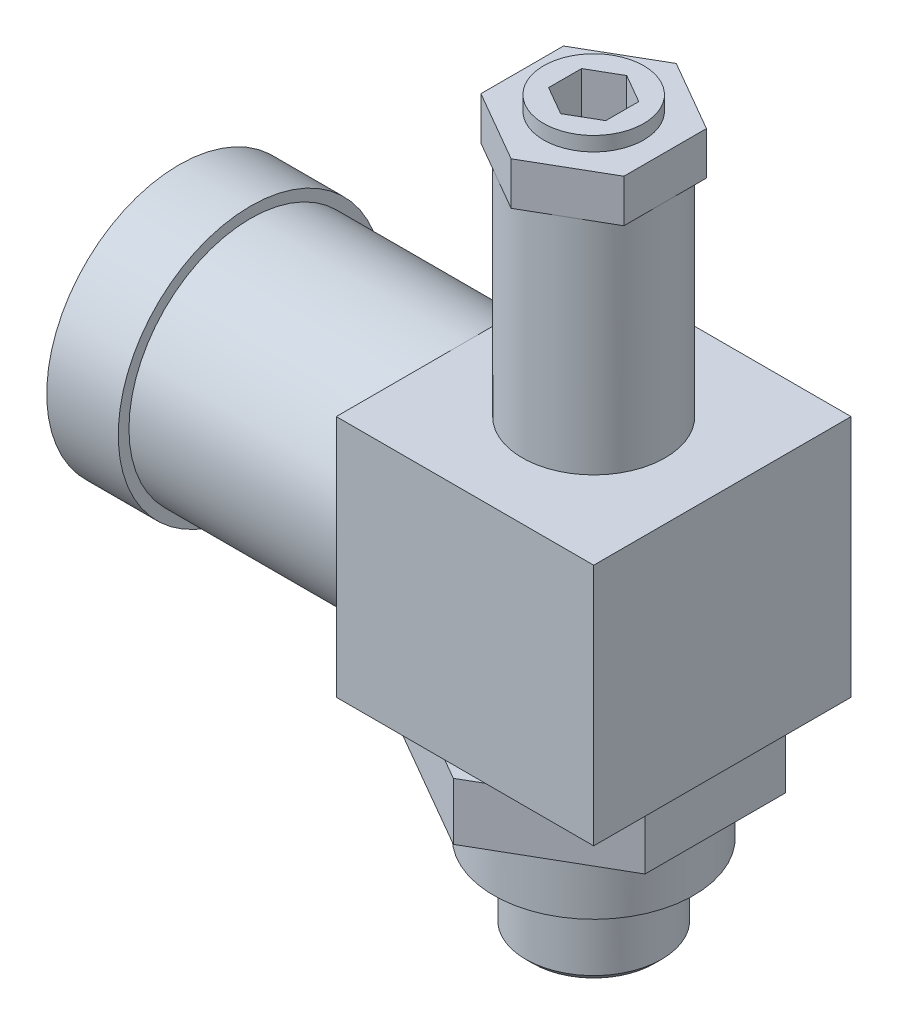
ISO-10303-21;
HEADER;
FILE_DESCRIPTION(('STEP AP214'),'2;1');
FILE_NAME('part.step','',(''),(''),'','','');
FILE_SCHEMA(('AUTOMOTIVE_DESIGN { 1 0 10303 214 1 1 1 1 }'));
ENDSEC;
DATA;
#1=APPLICATION_CONTEXT('core data for automotive mechanical design processes');
#2=APPLICATION_PROTOCOL_DEFINITION('international standard','automotive_design',2000,#1);
#3=PRODUCT_CONTEXT('',#1,'mechanical');
#4=PRODUCT('Part','Part','',(#3));
#5=PRODUCT_RELATED_PRODUCT_CATEGORY('part','',(#4));
#6=PRODUCT_DEFINITION_FORMATION('','',#4);
#7=PRODUCT_DEFINITION_CONTEXT('part definition',#1,'design');
#8=PRODUCT_DEFINITION('design','',#6,#7);
#9=PRODUCT_DEFINITION_SHAPE('','',#8);
#10=(LENGTH_UNIT() NAMED_UNIT(*) SI_UNIT(.MILLI.,.METRE.));
#11=(NAMED_UNIT(*) PLANE_ANGLE_UNIT() SI_UNIT($,.RADIAN.));
#12=(NAMED_UNIT(*) SI_UNIT($,.STERADIAN.) SOLID_ANGLE_UNIT());
#13=UNCERTAINTY_MEASURE_WITH_UNIT(LENGTH_MEASURE(1.E-05),#10,'distance_accuracy_value','');
#14=(GEOMETRIC_REPRESENTATION_CONTEXT(3) GLOBAL_UNCERTAINTY_ASSIGNED_CONTEXT((#13)) GLOBAL_UNIT_ASSIGNED_CONTEXT((#10,
#11,#12)) REPRESENTATION_CONTEXT('',''));
#15=CARTESIAN_POINT('',(0.,0.,0.));
#16=DIRECTION('',(0.,0.,1.));
#17=DIRECTION('',(1.,0.,0.));
#18=AXIS2_PLACEMENT_3D('',#15,#16,#17);
#19=CARTESIAN_POINT('',(-9.,-8.5,9.));
#20=DIRECTION('',(0.,1.,0.));
#21=DIRECTION('',(0.,0.,1.));
#22=AXIS2_PLACEMENT_3D('',#19,#20,#21);
#23=PLANE('',#22);
#24=DIRECTION('',(-0.866025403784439,0.,-0.5));
#25=VECTOR('',#24,1.);
#26=CARTESIAN_POINT('',(0.,-8.5,9.81495457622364));
#27=LINE('',#26,#25);
#28=CARTESIAN_POINT('',(-1.41154273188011,-8.5,9.));
#29=VERTEX_POINT('',#28);
#30=CARTESIAN_POINT('',(-8.5,-8.5,4.90747728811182));
#31=VERTEX_POINT('',#30);
#32=EDGE_CURVE('E235',#29,#31,#27,.T.);
#33=ORIENTED_EDGE('',*,*,#32,.F.);
#34=DIRECTION('',(1.,0.,0.));
#35=VECTOR('',#34,1.);
#36=CARTESIAN_POINT('',(-9.,-8.5,9.));
#37=LINE('',#36,#35);
#38=CARTESIAN_POINT('',(-9.,-8.5,9.));
#39=VERTEX_POINT('',#38);
#40=EDGE_CURVE('E383',#39,#29,#37,.T.);
#41=ORIENTED_EDGE('',*,*,#40,.F.);
#42=DIRECTION('',(0.,0.,-1.));
#43=VECTOR('',#42,1.);
#44=CARTESIAN_POINT('',(-9.,-8.5,9.));
#45=LINE('',#44,#43);
#46=CARTESIAN_POINT('',(-9.,-8.5,0.));
#47=VERTEX_POINT('',#46);
#48=EDGE_CURVE('E401',#39,#47,#45,.T.);
#49=ORIENTED_EDGE('',*,*,#48,.T.);
#50=CARTESIAN_POINT('',(-9.,-8.5,-9.));
#51=VERTEX_POINT('',#50);
#52=EDGE_CURVE('E400',#47,#51,#45,.T.);
#53=ORIENTED_EDGE('',*,*,#52,.T.);
#54=DIRECTION('',(1.,0.,0.));
#55=VECTOR('',#54,1.);
#56=CARTESIAN_POINT('',(-9.,-8.5,-9.));
#57=LINE('',#56,#55);
#58=CARTESIAN_POINT('',(-1.41154273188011,-8.5,-9.));
#59=VERTEX_POINT('',#58);
#60=EDGE_CURVE('E372',#51,#59,#57,.T.);
#61=ORIENTED_EDGE('',*,*,#60,.T.);
#62=DIRECTION('',(0.866025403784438,0.,-0.5));
#63=VECTOR('',#62,1.);
#64=CARTESIAN_POINT('',(-8.5,-8.5,-4.90747728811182));
#65=LINE('',#64,#63);
#66=CARTESIAN_POINT('',(-8.5,-8.5,-4.90747728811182));
#67=VERTEX_POINT('',#66);
#68=EDGE_CURVE('E53',#67,#59,#65,.T.);
#69=ORIENTED_EDGE('',*,*,#68,.F.);
#70=DIRECTION('',(0.,0.,-1.));
#71=VECTOR('',#70,1.);
#72=CARTESIAN_POINT('',(-8.5,-8.5,4.90747728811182));
#73=LINE('',#72,#71);
#74=EDGE_CURVE('E48',#31,#67,#73,.T.);
#75=ORIENTED_EDGE('',*,*,#74,.F.);
#76=EDGE_LOOP('',(#33,#41,#49,#53,#61,#69,#75));
#77=FACE_BOUND('',#76,.T.);
#78=ADVANCED_FACE('F33',(#77),#23,.F.);
#79=DIRECTION('',(-0.866025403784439,0.,0.5));
#80=VECTOR('',#79,1.);
#81=CARTESIAN_POINT('',(8.5,-8.5,4.90747728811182));
#82=LINE('',#81,#80);
#83=CARTESIAN_POINT('',(8.49999999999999,-8.5,4.90747728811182));
#84=VERTEX_POINT('',#83);
#85=CARTESIAN_POINT('',(1.4115427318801,-8.5,9.));
#86=VERTEX_POINT('',#85);
#87=EDGE_CURVE('E225',#84,#86,#82,.T.);
#88=ORIENTED_EDGE('',*,*,#87,.F.);
#89=DIRECTION('',(0.,0.,1.));
#90=VECTOR('',#89,1.);
#91=CARTESIAN_POINT('',(8.5,-8.5,-4.90747728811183));
#92=LINE('',#91,#90);
#93=CARTESIAN_POINT('',(8.49999999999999,-8.5,-4.90747728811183));
#94=VERTEX_POINT('',#93);
#95=EDGE_CURVE('E568',#94,#84,#92,.T.);
#96=ORIENTED_EDGE('',*,*,#95,.F.);
#97=DIRECTION('',(0.866025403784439,0.,0.5));
#98=VECTOR('',#97,1.);
#99=CARTESIAN_POINT('',(0.,-8.5,-9.81495457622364));
#100=LINE('',#99,#98);
#101=CARTESIAN_POINT('',(1.41154273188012,-8.5,-9.));
#102=VERTEX_POINT('',#101);
#103=EDGE_CURVE('E563',#102,#94,#100,.T.);
#104=ORIENTED_EDGE('',*,*,#103,.F.);
#105=CARTESIAN_POINT('',(9.,-8.5,-9.));
#106=VERTEX_POINT('',#105);
#107=EDGE_CURVE('E371',#102,#106,#57,.T.);
#108=ORIENTED_EDGE('',*,*,#107,.T.);
#109=DIRECTION('',(0.,0.,-1.));
#110=VECTOR('',#109,1.);
#111=CARTESIAN_POINT('',(9.,-8.5,9.));
#112=LINE('',#111,#110);
#113=CARTESIAN_POINT('',(9.,-8.5,9.));
#114=VERTEX_POINT('',#113);
#115=EDGE_CURVE('E397',#114,#106,#112,.T.);
#116=ORIENTED_EDGE('',*,*,#115,.F.);
#117=EDGE_CURVE('E382',#86,#114,#37,.T.);
#118=ORIENTED_EDGE('',*,*,#117,.F.);
#119=EDGE_LOOP('',(#88,#96,#104,#108,#116,#118));
#120=FACE_BOUND('',#119,.T.);
#121=ADVANCED_FACE('F460',(#120),#23,.F.);
#122=CARTESIAN_POINT('',(-9.,8.5,9.));
#123=DIRECTION('',(0.,-1.,0.));
#124=DIRECTION('',(0.,0.,-1.));
#125=AXIS2_PLACEMENT_3D('',#122,#123,#124);
#126=PLANE('',#125);
#127=DIRECTION('',(-1.,0.,0.));
#128=VECTOR('',#127,1.);
#129=CARTESIAN_POINT('',(-9.,8.5,-9.));
#130=LINE('',#129,#128);
#131=CARTESIAN_POINT('',(9.,8.5,-9.));
#132=VERTEX_POINT('',#131);
#133=CARTESIAN_POINT('',(-9.,8.5,-9.));
#134=VERTEX_POINT('',#133);
#135=EDGE_CURVE('E376',#132,#134,#130,.T.);
#136=ORIENTED_EDGE('',*,*,#135,.T.);
#137=DIRECTION('',(0.,0.,-1.));
#138=VECTOR('',#137,1.);
#139=CARTESIAN_POINT('',(-9.,8.5,9.));
#140=LINE('',#139,#138);
#141=CARTESIAN_POINT('',(-9.,8.5,0.));
#142=VERTEX_POINT('',#141);
#143=EDGE_CURVE('E390',#142,#134,#140,.T.);
#144=ORIENTED_EDGE('',*,*,#143,.F.);
#145=CARTESIAN_POINT('',(-9.,8.5,9.));
#146=VERTEX_POINT('',#145);
#147=EDGE_CURVE('E391',#146,#142,#140,.T.);
#148=ORIENTED_EDGE('',*,*,#147,.F.);
#149=DIRECTION('',(-1.,0.,0.));
#150=VECTOR('',#149,1.);
#151=CARTESIAN_POINT('',(-9.,8.5,9.));
#152=LINE('',#151,#150);
#153=CARTESIAN_POINT('',(9.,8.5,9.));
#154=VERTEX_POINT('',#153);
#155=EDGE_CURVE('E388',#154,#146,#152,.T.);
#156=ORIENTED_EDGE('',*,*,#155,.F.);
#157=DIRECTION('',(0.,0.,-1.));
#158=VECTOR('',#157,1.);
#159=CARTESIAN_POINT('',(9.,8.5,9.));
#160=LINE('',#159,#158);
#161=EDGE_CURVE('E394',#154,#132,#160,.T.);
#162=ORIENTED_EDGE('',*,*,#161,.T.);
#163=EDGE_LOOP('',(#136,#144,#148,#156,#162));
#164=FACE_BOUND('',#163,.T.);
#165=CARTESIAN_POINT('',(0.,8.5,0.));
#166=DIRECTION('',(0.,-1.,0.));
#167=DIRECTION('',(0.,0.,-1.));
#168=AXIS2_PLACEMENT_3D('',#165,#166,#167);
#169=CIRCLE('',#168,5.);
#170=CARTESIAN_POINT('',(0.,8.5,-5.));
#171=VERTEX_POINT('',#170);
#172=EDGE_CURVE('E434',#171,#171,#169,.F.);
#173=ORIENTED_EDGE('',*,*,#172,.F.);
#174=EDGE_LOOP('',(#173));
#175=FACE_BOUND('',#174,.T.);
#176=ADVANCED_FACE('F465',(#164,#175),#126,.F.);
#177=CARTESIAN_POINT('',(-24.,0.,0.));
#178=DIRECTION('',(1.,0.,0.));
#179=DIRECTION('',(0.,1.,0.));
#180=AXIS2_PLACEMENT_3D('',#177,#178,#179);
#181=PLANE('',#180);
#182=CARTESIAN_POINT('',(-24.,0.,0.));
#183=DIRECTION('',(-1.,0.,0.));
#184=DIRECTION('',(0.,-1.,0.));
#185=AXIS2_PLACEMENT_3D('',#182,#183,#184);
#186=CIRCLE('',#185,2.);
#187=CARTESIAN_POINT('',(-24.,-2.,0.));
#188=VERTEX_POINT('',#187);
#189=EDGE_CURVE('E431',#188,#188,#186,.T.);
#190=ORIENTED_EDGE('',*,*,#189,.T.);
#191=EDGE_LOOP('',(#190));
#192=FACE_BOUND('',#191,.T.);
#193=ADVANCED_FACE('F35',(#192),#181,.F.);
#194=CARTESIAN_POINT('',(-9.,0.,0.));
#195=DIRECTION('',(-1.,0.,0.));
#196=DIRECTION('',(0.,-1.,0.));
#197=AXIS2_PLACEMENT_3D('',#194,#195,#196);
#198=CYLINDRICAL_SURFACE('',#197,2.);
#199=ORIENTED_EDGE('',*,*,#189,.F.);
#200=EDGE_LOOP('',(#199));
#201=FACE_BOUND('',#200,.T.);
#202=CARTESIAN_POINT('',(-32.,0.,0.));
#203=DIRECTION('',(-1.,0.,0.));
#204=DIRECTION('',(0.,-1.,0.));
#205=AXIS2_PLACEMENT_3D('',#202,#203,#204);
#206=CIRCLE('',#205,2.);
#207=CARTESIAN_POINT('',(-32.,-2.,0.));
#208=VERTEX_POINT('',#207);
#209=EDGE_CURVE('E428',#208,#208,#206,.T.);
#210=ORIENTED_EDGE('',*,*,#209,.T.);
#211=EDGE_LOOP('',(#210));
#212=FACE_BOUND('',#211,.T.);
#213=ADVANCED_FACE('F506',(#201,#212),#198,.F.);
#214=CARTESIAN_POINT('',(-32.,2.,0.));
#215=DIRECTION('',(1.,0.,0.));
#216=DIRECTION('',(0.,1.,0.));
#217=AXIS2_PLACEMENT_3D('',#214,#215,#216);
#218=PLANE('',#217);
#219=ORIENTED_EDGE('',*,*,#209,.F.);
#220=EDGE_LOOP('',(#219));
#221=FACE_BOUND('',#220,.T.);
#222=CARTESIAN_POINT('',(-32.,0.,0.));
#223=DIRECTION('',(-1.,0.,0.));
#224=DIRECTION('',(0.,-1.,0.));
#225=AXIS2_PLACEMENT_3D('',#222,#223,#224);
#226=CIRCLE('',#225,4.25);
#227=CARTESIAN_POINT('',(-32.,-4.25,0.));
#228=VERTEX_POINT('',#227);
#229=EDGE_CURVE('E425',#228,#228,#226,.T.);
#230=ORIENTED_EDGE('',*,*,#229,.T.);
#231=EDGE_LOOP('',(#230));
#232=FACE_BOUND('',#231,.T.);
#233=ADVANCED_FACE('F503',(#221,#232),#218,.F.);
#234=CARTESIAN_POINT('',(-9.,0.,0.));
#235=DIRECTION('',(-1.,0.,0.));
#236=DIRECTION('',(0.,-1.,0.));
#237=AXIS2_PLACEMENT_3D('',#234,#235,#236);
#238=CYLINDRICAL_SURFACE('',#237,4.25);
#239=ORIENTED_EDGE('',*,*,#229,.F.);
#240=EDGE_LOOP('',(#239));
#241=FACE_BOUND('',#240,.T.);
#242=CARTESIAN_POINT('',(-30.,0.,0.));
#243=DIRECTION('',(-1.,0.,0.));
#244=DIRECTION('',(0.,-1.,0.));
#245=AXIS2_PLACEMENT_3D('',#242,#243,#244);
#246=CIRCLE('',#245,4.25);
#247=CARTESIAN_POINT('',(-30.,-4.25,0.));
#248=VERTEX_POINT('',#247);
#249=EDGE_CURVE('E422',#248,#248,#246,.T.);
#250=ORIENTED_EDGE('',*,*,#249,.T.);
#251=EDGE_LOOP('',(#250));
#252=FACE_BOUND('',#251,.T.);
#253=ADVANCED_FACE('F499',(#241,#252),#238,.T.);
#254=CARTESIAN_POINT('',(-30.,4.25,0.));
#255=DIRECTION('',(-1.,0.,0.));
#256=DIRECTION('',(0.,-1.,0.));
#257=AXIS2_PLACEMENT_3D('',#254,#255,#256);
#258=PLANE('',#257);
#259=ORIENTED_EDGE('',*,*,#249,.F.);
#260=EDGE_LOOP('',(#259));
#261=FACE_BOUND('',#260,.T.);
#262=CARTESIAN_POINT('',(-30.,0.,0.));
#263=DIRECTION('',(-1.,0.,0.));
#264=DIRECTION('',(0.,-1.,0.));
#265=AXIS2_PLACEMENT_3D('',#262,#263,#264);
#266=CIRCLE('',#265,3.5);
#267=CARTESIAN_POINT('',(-30.,-3.5,0.));
#268=VERTEX_POINT('',#267);
#269=EDGE_CURVE('E419',#268,#268,#266,.T.);
#270=ORIENTED_EDGE('',*,*,#269,.T.);
#271=EDGE_LOOP('',(#270));
#272=FACE_BOUND('',#271,.T.);
#273=ADVANCED_FACE('F495',(#261,#272),#258,.F.);
#274=CARTESIAN_POINT('',(-9.,0.,0.));
#275=DIRECTION('',(-1.,0.,0.));
#276=DIRECTION('',(0.,-1.,0.));
#277=AXIS2_PLACEMENT_3D('',#274,#275,#276);
#278=CYLINDRICAL_SURFACE('',#277,3.5);
#279=ORIENTED_EDGE('',*,*,#269,.F.);
#280=EDGE_LOOP('',(#279));
#281=FACE_BOUND('',#280,.T.);
#282=CARTESIAN_POINT('',(-29.,0.,0.));
#283=DIRECTION('',(-1.,0.,0.));
#284=DIRECTION('',(0.,-1.,0.));
#285=AXIS2_PLACEMENT_3D('',#282,#283,#284);
#286=CIRCLE('',#285,3.5);
#287=CARTESIAN_POINT('',(-29.,-3.5,0.));
#288=VERTEX_POINT('',#287);
#289=EDGE_CURVE('E416',#288,#288,#286,.T.);
#290=ORIENTED_EDGE('',*,*,#289,.T.);
#291=EDGE_LOOP('',(#290));
#292=FACE_BOUND('',#291,.T.);
#293=ADVANCED_FACE('F491',(#281,#292),#278,.T.);
#294=CARTESIAN_POINT('',(-29.,3.5,0.));
#295=DIRECTION('',(1.,0.,0.));
#296=DIRECTION('',(0.,1.,0.));
#297=AXIS2_PLACEMENT_3D('',#294,#295,#296);
#298=PLANE('',#297);
#299=ORIENTED_EDGE('',*,*,#289,.F.);
#300=EDGE_LOOP('',(#299));
#301=FACE_BOUND('',#300,.T.);
#302=CARTESIAN_POINT('',(-29.,0.,0.));
#303=DIRECTION('',(-1.,0.,0.));
#304=DIRECTION('',(0.,-1.,0.));
#305=AXIS2_PLACEMENT_3D('',#302,#303,#304);
#306=CIRCLE('',#305,9.25);
#307=CARTESIAN_POINT('',(-29.,-9.25,0.));
#308=VERTEX_POINT('',#307);
#309=EDGE_CURVE('E413',#308,#308,#306,.T.);
#310=ORIENTED_EDGE('',*,*,#309,.T.);
#311=EDGE_LOOP('',(#310));
#312=FACE_BOUND('',#311,.T.);
#313=ADVANCED_FACE('F487',(#301,#312),#298,.F.);
#314=CARTESIAN_POINT('',(-9.,0.,0.));
#315=DIRECTION('',(-1.,0.,0.));
#316=DIRECTION('',(0.,-1.,0.));
#317=AXIS2_PLACEMENT_3D('',#314,#315,#316);
#318=CYLINDRICAL_SURFACE('',#317,9.25);
#319=ORIENTED_EDGE('',*,*,#309,.F.);
#320=EDGE_LOOP('',(#319));
#321=FACE_BOUND('',#320,.T.);
#322=CARTESIAN_POINT('',(-24.,0.,0.));
#323=DIRECTION('',(-1.,0.,0.));
#324=DIRECTION('',(0.,-1.,0.));
#325=AXIS2_PLACEMENT_3D('',#322,#323,#324);
#326=CIRCLE('',#325,9.25);
#327=CARTESIAN_POINT('',(-24.,-9.25,0.));
#328=VERTEX_POINT('',#327);
#329=EDGE_CURVE('E410',#328,#328,#326,.T.);
#330=ORIENTED_EDGE('',*,*,#329,.T.);
#331=EDGE_LOOP('',(#330));
#332=FACE_BOUND('',#331,.T.);
#333=ADVANCED_FACE('F483',(#321,#332),#318,.T.);
#334=CARTESIAN_POINT('',(-24.,9.25,0.));
#335=DIRECTION('',(-1.,0.,0.));
#336=DIRECTION('',(0.,-1.,0.));
#337=AXIS2_PLACEMENT_3D('',#334,#335,#336);
#338=PLANE('',#337);
#339=ORIENTED_EDGE('',*,*,#329,.F.);
#340=EDGE_LOOP('',(#339));
#341=FACE_BOUND('',#340,.T.);
#342=CARTESIAN_POINT('',(-24.,0.,0.));
#343=DIRECTION('',(-1.,0.,0.));
#344=DIRECTION('',(0.,-1.,0.));
#345=AXIS2_PLACEMENT_3D('',#342,#343,#344);
#346=CIRCLE('',#345,8.5);
#347=CARTESIAN_POINT('',(-24.,-8.5,0.));
#348=VERTEX_POINT('',#347);
#349=EDGE_CURVE('E407',#348,#348,#346,.T.);
#350=ORIENTED_EDGE('',*,*,#349,.T.);
#351=EDGE_LOOP('',(#350));
#352=FACE_BOUND('',#351,.T.);
#353=ADVANCED_FACE('F479',(#341,#352),#338,.F.);
#354=CARTESIAN_POINT('',(-9.,0.,0.));
#355=DIRECTION('',(-1.,0.,0.));
#356=DIRECTION('',(0.,-1.,0.));
#357=AXIS2_PLACEMENT_3D('',#354,#355,#356);
#358=CYLINDRICAL_SURFACE('',#357,8.5);
#359=ORIENTED_EDGE('',*,*,#349,.F.);
#360=EDGE_LOOP('',(#359));
#361=FACE_BOUND('',#360,.T.);
#362=CARTESIAN_POINT('',(-9.,0.,0.));
#363=DIRECTION('',(-1.,0.,0.));
#364=DIRECTION('',(0.,-1.,0.));
#365=AXIS2_PLACEMENT_3D('',#362,#363,#364);
#366=CIRCLE('',#365,8.5);
#367=EDGE_CURVE('E404',#47,#142,#366,.T.);
#368=ORIENTED_EDGE('',*,*,#367,.T.);
#369=EDGE_CURVE('E403',#142,#47,#366,.T.);
#370=ORIENTED_EDGE('',*,*,#369,.T.);
#371=EDGE_LOOP('',(#368,#370));
#372=FACE_BOUND('',#371,.T.);
#373=ADVANCED_FACE('F476',(#361,#372),#358,.T.);
#374=CARTESIAN_POINT('',(-9.,8.5,9.));
#375=DIRECTION('',(1.,0.,0.));
#376=DIRECTION('',(0.,0.,-1.));
#377=AXIS2_PLACEMENT_3D('',#374,#375,#376);
#378=PLANE('',#377);
#379=ORIENTED_EDGE('',*,*,#367,.F.);
#380=ORIENTED_EDGE('',*,*,#48,.F.);
#381=DIRECTION('',(0.,-1.,0.));
#382=VECTOR('',#381,1.);
#383=CARTESIAN_POINT('',(-9.,8.5,9.));
#384=LINE('',#383,#382);
#385=EDGE_CURVE('E379',#146,#39,#384,.T.);
#386=ORIENTED_EDGE('',*,*,#385,.F.);
#387=ORIENTED_EDGE('',*,*,#147,.T.);
#388=EDGE_LOOP('',(#379,#380,#386,#387));
#389=FACE_BOUND('',#388,.T.);
#390=ADVANCED_FACE('F474',(#389),#378,.F.);
#391=ORIENTED_EDGE('',*,*,#369,.F.);
#392=ORIENTED_EDGE('',*,*,#143,.T.);
#393=DIRECTION('',(0.,-1.,0.));
#394=VECTOR('',#393,1.);
#395=CARTESIAN_POINT('',(-9.,8.5,-9.));
#396=LINE('',#395,#394);
#397=EDGE_CURVE('E367',#134,#51,#396,.T.);
#398=ORIENTED_EDGE('',*,*,#397,.T.);
#399=ORIENTED_EDGE('',*,*,#52,.F.);
#400=EDGE_LOOP('',(#391,#392,#398,#399));
#401=FACE_BOUND('',#400,.T.);
#402=ADVANCED_FACE('F471',(#401),#378,.F.);
#403=CARTESIAN_POINT('',(9.,8.5,9.));
#404=DIRECTION('',(-1.,0.,0.));
#405=DIRECTION('',(0.,0.,1.));
#406=AXIS2_PLACEMENT_3D('',#403,#404,#405);
#407=PLANE('',#406);
#408=DIRECTION('',(0.,1.,0.));
#409=VECTOR('',#408,1.);
#410=CARTESIAN_POINT('',(9.,8.5,-9.));
#411=LINE('',#410,#409);
#412=EDGE_CURVE('E374',#106,#132,#411,.T.);
#413=ORIENTED_EDGE('',*,*,#412,.T.);
#414=ORIENTED_EDGE('',*,*,#161,.F.);
#415=DIRECTION('',(0.,1.,0.));
#416=VECTOR('',#415,1.);
#417=CARTESIAN_POINT('',(9.,8.5,9.));
#418=LINE('',#417,#416);
#419=EDGE_CURVE('E386',#114,#154,#418,.T.);
#420=ORIENTED_EDGE('',*,*,#419,.F.);
#421=ORIENTED_EDGE('',*,*,#115,.T.);
#422=EDGE_LOOP('',(#413,#414,#420,#421));
#423=FACE_BOUND('',#422,.T.);
#424=ADVANCED_FACE('F469',(#423),#407,.F.);
#425=CARTESIAN_POINT('',(-9.,-8.5,9.));
#426=DIRECTION('',(0.,0.,1.));
#427=DIRECTION('',(1.,0.,0.));
#428=AXIS2_PLACEMENT_3D('',#425,#426,#427);
#429=PLANE('',#428);
#430=ORIENTED_EDGE('',*,*,#385,.T.);
#431=ORIENTED_EDGE('',*,*,#40,.T.);
#432=DIRECTION('',(-1.,0.,0.));
#433=VECTOR('',#432,1.);
#434=CARTESIAN_POINT('',(-9.,-8.5,9.));
#435=LINE('',#434,#433);
#436=EDGE_CURVE('E233',#86,#29,#435,.T.);
#437=ORIENTED_EDGE('',*,*,#436,.F.);
#438=ORIENTED_EDGE('',*,*,#117,.T.);
#439=ORIENTED_EDGE('',*,*,#419,.T.);
#440=ORIENTED_EDGE('',*,*,#155,.T.);
#441=EDGE_LOOP('',(#430,#431,#437,#438,#439,#440));
#442=FACE_BOUND('',#441,.T.);
#443=ADVANCED_FACE('F599',(#442),#429,.T.);
#444=CARTESIAN_POINT('',(-9.,-8.5,-9.));
#445=DIRECTION('',(0.,0.,1.));
#446=DIRECTION('',(1.,0.,0.));
#447=AXIS2_PLACEMENT_3D('',#444,#445,#446);
#448=PLANE('',#447);
#449=ORIENTED_EDGE('',*,*,#397,.F.);
#450=ORIENTED_EDGE('',*,*,#135,.F.);
#451=ORIENTED_EDGE('',*,*,#412,.F.);
#452=ORIENTED_EDGE('',*,*,#107,.F.);
#453=DIRECTION('',(-1.,0.,0.));
#454=VECTOR('',#453,1.);
#455=CARTESIAN_POINT('',(-9.,-8.5,-9.));
#456=LINE('',#455,#454);
#457=EDGE_CURVE('E241',#102,#59,#456,.T.);
#458=ORIENTED_EDGE('',*,*,#457,.T.);
#459=ORIENTED_EDGE('',*,*,#60,.F.);
#460=EDGE_LOOP('',(#449,#450,#451,#452,#458,#459));
#461=FACE_BOUND('',#460,.T.);
#462=ADVANCED_FACE('F548',(#461),#448,.F.);
#463=CARTESIAN_POINT('',(0.,0.,0.));
#464=DIRECTION('',(0.,-1.,0.));
#465=DIRECTION('',(0.,0.,-1.));
#466=AXIS2_PLACEMENT_3D('',#463,#464,#465);
#467=CYLINDRICAL_SURFACE('',#466,5.);
#468=CARTESIAN_POINT('',(0.,24.,0.));
#469=DIRECTION('',(0.,-1.,0.));
#470=DIRECTION('',(0.,0.,-1.));
#471=AXIS2_PLACEMENT_3D('',#468,#469,#470);
#472=CIRCLE('',#471,5.);
#473=CARTESIAN_POINT('',(2.5,24.,-4.33012701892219));
#474=VERTEX_POINT('',#473);
#475=CARTESIAN_POINT('',(5.,24.,0.));
#476=VERTEX_POINT('',#475);
#477=EDGE_CURVE('E364',#474,#476,#472,.T.);
#478=ORIENTED_EDGE('',*,*,#477,.T.);
#479=CARTESIAN_POINT('',(2.5,24.,4.3301270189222));
#480=VERTEX_POINT('',#479);
#481=EDGE_CURVE('E368',#476,#480,#472,.T.);
#482=ORIENTED_EDGE('',*,*,#481,.T.);
#483=CARTESIAN_POINT('',(-2.5,24.,4.33012701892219));
#484=VERTEX_POINT('',#483);
#485=EDGE_CURVE('E1060',#480,#484,#472,.T.);
#486=ORIENTED_EDGE('',*,*,#485,.T.);
#487=CARTESIAN_POINT('',(-5.,24.,0.));
#488=VERTEX_POINT('',#487);
#489=EDGE_CURVE('E1066',#484,#488,#472,.T.);
#490=ORIENTED_EDGE('',*,*,#489,.T.);
#491=CARTESIAN_POINT('',(-2.5,24.,-4.3301270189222));
#492=VERTEX_POINT('',#491);
#493=EDGE_CURVE('E1068',#488,#492,#472,.T.);
#494=ORIENTED_EDGE('',*,*,#493,.T.);
#495=EDGE_CURVE('E363',#492,#474,#472,.T.);
#496=ORIENTED_EDGE('',*,*,#495,.T.);
#497=EDGE_LOOP('',(#478,#482,#486,#490,#494,#496));
#498=FACE_BOUND('',#497,.T.);
#499=ORIENTED_EDGE('',*,*,#172,.T.);
#500=EDGE_LOOP('',(#499));
#501=FACE_BOUND('',#500,.T.);
#502=ADVANCED_FACE('F669',(#498,#501),#467,.T.);
#503=CARTESIAN_POINT('',(-5.,27.,-2.88675134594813));
#504=DIRECTION('',(0.,1.,0.));
#505=DIRECTION('',(0.,0.,1.));
#506=AXIS2_PLACEMENT_3D('',#503,#504,#505);
#507=PLANE('',#506);
#508=DIRECTION('',(-0.866025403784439,0.,0.5));
#509=VECTOR('',#508,1.);
#510=CARTESIAN_POINT('',(0.,27.,-5.77350269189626));
#511=LINE('',#510,#509);
#512=CARTESIAN_POINT('',(0.,27.,-5.77350269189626));
#513=VERTEX_POINT('',#512);
#514=CARTESIAN_POINT('',(-5.,27.,-2.88675134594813));
#515=VERTEX_POINT('',#514);
#516=EDGE_CURVE('E322',#513,#515,#511,.T.);
#517=ORIENTED_EDGE('',*,*,#516,.T.);
#518=DIRECTION('',(0.,0.,1.));
#519=VECTOR('',#518,1.);
#520=CARTESIAN_POINT('',(-5.,27.,-2.88675134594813));
#521=LINE('',#520,#519);
#522=CARTESIAN_POINT('',(-5.,27.,2.88675134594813));
#523=VERTEX_POINT('',#522);
#524=EDGE_CURVE('E325',#515,#523,#521,.T.);
#525=ORIENTED_EDGE('',*,*,#524,.T.);
#526=DIRECTION('',(0.866025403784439,0.,0.5));
#527=VECTOR('',#526,1.);
#528=CARTESIAN_POINT('',(-5.,27.,2.88675134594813));
#529=LINE('',#528,#527);
#530=CARTESIAN_POINT('',(0.,27.,5.77350269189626));
#531=VERTEX_POINT('',#530);
#532=EDGE_CURVE('E327',#523,#531,#529,.T.);
#533=ORIENTED_EDGE('',*,*,#532,.T.);
#534=DIRECTION('',(0.866025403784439,0.,-0.5));
#535=VECTOR('',#534,1.);
#536=CARTESIAN_POINT('',(0.,27.,5.77350269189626));
#537=LINE('',#536,#535);
#538=CARTESIAN_POINT('',(5.,27.,2.88675134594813));
#539=VERTEX_POINT('',#538);
#540=EDGE_CURVE('E329',#531,#539,#537,.T.);
#541=ORIENTED_EDGE('',*,*,#540,.T.);
#542=DIRECTION('',(0.,0.,-1.));
#543=VECTOR('',#542,1.);
#544=CARTESIAN_POINT('',(5.,27.,2.88675134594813));
#545=LINE('',#544,#543);
#546=CARTESIAN_POINT('',(5.,27.,-2.88675134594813));
#547=VERTEX_POINT('',#546);
#548=EDGE_CURVE('E331',#539,#547,#545,.T.);
#549=ORIENTED_EDGE('',*,*,#548,.T.);
#550=DIRECTION('',(-0.866025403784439,0.,-0.5));
#551=VECTOR('',#550,1.);
#552=CARTESIAN_POINT('',(5.,27.,-2.88675134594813));
#553=LINE('',#552,#551);
#554=EDGE_CURVE('E333',#547,#513,#553,.T.);
#555=ORIENTED_EDGE('',*,*,#554,.T.);
#556=EDGE_LOOP('',(#517,#525,#533,#541,#549,#555));
#557=FACE_BOUND('',#556,.T.);
#558=CARTESIAN_POINT('',(0.,27.,0.));
#559=DIRECTION('',(0.,1.,0.));
#560=DIRECTION('',(0.,0.,1.));
#561=AXIS2_PLACEMENT_3D('',#558,#559,#560);
#562=CIRCLE('',#561,3.5);
#563=CARTESIAN_POINT('',(0.,27.,3.5));
#564=VERTEX_POINT('',#563);
#565=EDGE_CURVE('E353',#564,#564,#562,.T.);
#566=ORIENTED_EDGE('',*,*,#565,.F.);
#567=EDGE_LOOP('',(#566));
#568=FACE_BOUND('',#567,.T.);
#569=ADVANCED_FACE('F664',(#557,#568),#507,.T.);
#570=CARTESIAN_POINT('',(-5.,24.,-2.88675134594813));
#571=DIRECTION('',(0.,1.,0.));
#572=DIRECTION('',(0.,0.,1.));
#573=AXIS2_PLACEMENT_3D('',#570,#571,#572);
#574=PLANE('',#573);
#575=DIRECTION('',(0.866025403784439,0.,-0.5));
#576=VECTOR('',#575,1.);
#577=CARTESIAN_POINT('',(0.,24.,5.77350269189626));
#578=LINE('',#577,#576);
#579=CARTESIAN_POINT('',(5.,24.,2.88675134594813));
#580=VERTEX_POINT('',#579);
#581=EDGE_CURVE('E310',#480,#580,#578,.T.);
#582=ORIENTED_EDGE('',*,*,#581,.F.);
#583=ORIENTED_EDGE('',*,*,#481,.F.);
#584=DIRECTION('',(0.,0.,-1.));
#585=VECTOR('',#584,1.);
#586=CARTESIAN_POINT('',(5.,24.,2.88675134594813));
#587=LINE('',#586,#585);
#588=EDGE_CURVE('E315',#580,#476,#587,.T.);
#589=ORIENTED_EDGE('',*,*,#588,.F.);
#590=EDGE_LOOP('',(#582,#583,#589));
#591=FACE_BOUND('',#590,.T.);
#592=ADVANCED_FACE('F660',(#591),#574,.F.);
#593=CARTESIAN_POINT('',(5.,24.,-2.88675134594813));
#594=VERTEX_POINT('',#593);
#595=EDGE_CURVE('E314',#476,#594,#587,.T.);
#596=ORIENTED_EDGE('',*,*,#595,.F.);
#597=ORIENTED_EDGE('',*,*,#477,.F.);
#598=DIRECTION('',(-0.866025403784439,0.,-0.5));
#599=VECTOR('',#598,1.);
#600=CARTESIAN_POINT('',(5.,24.,-2.88675134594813));
#601=LINE('',#600,#599);
#602=EDGE_CURVE('E319',#594,#474,#601,.T.);
#603=ORIENTED_EDGE('',*,*,#602,.F.);
#604=EDGE_LOOP('',(#596,#597,#603));
#605=FACE_BOUND('',#604,.T.);
#606=ADVANCED_FACE('F663',(#605),#574,.F.);
#607=CARTESIAN_POINT('',(0.,24.,-5.77350269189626));
#608=VERTEX_POINT('',#607);
#609=EDGE_CURVE('E318',#474,#608,#601,.T.);
#610=ORIENTED_EDGE('',*,*,#609,.F.);
#611=ORIENTED_EDGE('',*,*,#495,.F.);
#612=DIRECTION('',(-0.866025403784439,0.,0.5));
#613=VECTOR('',#612,1.);
#614=CARTESIAN_POINT('',(0.,24.,-5.77350269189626));
#615=LINE('',#614,#613);
#616=EDGE_CURVE('E300',#608,#492,#615,.T.);
#617=ORIENTED_EDGE('',*,*,#616,.F.);
#618=EDGE_LOOP('',(#610,#611,#617));
#619=FACE_BOUND('',#618,.T.);
#620=ADVANCED_FACE('F827',(#619),#574,.F.);
#621=CARTESIAN_POINT('',(-5.,24.,-2.88675134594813));
#622=VERTEX_POINT('',#621);
#623=EDGE_CURVE('E289',#492,#622,#615,.T.);
#624=ORIENTED_EDGE('',*,*,#623,.F.);
#625=ORIENTED_EDGE('',*,*,#493,.F.);
#626=DIRECTION('',(0.,0.,1.));
#627=VECTOR('',#626,1.);
#628=CARTESIAN_POINT('',(-5.,24.,-2.88675134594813));
#629=LINE('',#628,#627);
#630=EDGE_CURVE('E304',#622,#488,#629,.T.);
#631=ORIENTED_EDGE('',*,*,#630,.F.);
#632=EDGE_LOOP('',(#624,#625,#631));
#633=FACE_BOUND('',#632,.T.);
#634=ADVANCED_FACE('F834',(#633),#574,.F.);
#635=CARTESIAN_POINT('',(-5.,24.,2.88675134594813));
#636=VERTEX_POINT('',#635);
#637=EDGE_CURVE('E303',#488,#636,#629,.T.);
#638=ORIENTED_EDGE('',*,*,#637,.F.);
#639=ORIENTED_EDGE('',*,*,#489,.F.);
#640=DIRECTION('',(0.866025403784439,0.,0.5));
#641=VECTOR('',#640,1.);
#642=CARTESIAN_POINT('',(-5.,24.,2.88675134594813));
#643=LINE('',#642,#641);
#644=EDGE_CURVE('E308',#636,#484,#643,.T.);
#645=ORIENTED_EDGE('',*,*,#644,.F.);
#646=EDGE_LOOP('',(#638,#639,#645));
#647=FACE_BOUND('',#646,.T.);
#648=ADVANCED_FACE('F841',(#647),#574,.F.);
#649=CARTESIAN_POINT('',(0.,24.,5.77350269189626));
#650=VERTEX_POINT('',#649);
#651=EDGE_CURVE('E307',#484,#650,#643,.T.);
#652=ORIENTED_EDGE('',*,*,#651,.F.);
#653=ORIENTED_EDGE('',*,*,#485,.F.);
#654=EDGE_CURVE('E311',#650,#480,#578,.T.);
#655=ORIENTED_EDGE('',*,*,#654,.F.);
#656=EDGE_LOOP('',(#652,#653,#655));
#657=FACE_BOUND('',#656,.T.);
#658=ADVANCED_FACE('F666',(#657),#574,.F.);
#659=CARTESIAN_POINT('',(0.,27.,-5.77350269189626));
#660=DIRECTION('',(0.5,0.,0.866025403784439));
#661=DIRECTION('',(0.866025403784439,0.,-0.5));
#662=AXIS2_PLACEMENT_3D('',#659,#660,#661);
#663=PLANE('',#662);
#664=ORIENTED_EDGE('',*,*,#616,.T.);
#665=ORIENTED_EDGE('',*,*,#623,.T.);
#666=DIRECTION('',(0.,-1.,0.));
#667=VECTOR('',#666,1.);
#668=CARTESIAN_POINT('',(-5.,27.,-2.88675134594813));
#669=LINE('',#668,#667);
#670=EDGE_CURVE('E350',#515,#622,#669,.T.);
#671=ORIENTED_EDGE('',*,*,#670,.F.);
#672=ORIENTED_EDGE('',*,*,#516,.F.);
#673=DIRECTION('',(0.,-1.,0.));
#674=VECTOR('',#673,1.);
#675=CARTESIAN_POINT('',(0.,27.,-5.77350269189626));
#676=LINE('',#675,#674);
#677=EDGE_CURVE('E335',#513,#608,#676,.T.);
#678=ORIENTED_EDGE('',*,*,#677,.T.);
#679=EDGE_LOOP('',(#664,#665,#671,#672,#678));
#680=FACE_BOUND('',#679,.T.);
#681=ADVANCED_FACE('F691',(#680),#663,.F.);
#682=CARTESIAN_POINT('',(-5.,27.,-2.88675134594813));
#683=DIRECTION('',(1.,0.,0.));
#684=DIRECTION('',(0.,0.,-1.));
#685=AXIS2_PLACEMENT_3D('',#682,#683,#684);
#686=PLANE('',#685);
#687=ORIENTED_EDGE('',*,*,#630,.T.);
#688=ORIENTED_EDGE('',*,*,#637,.T.);
#689=DIRECTION('',(0.,-1.,0.));
#690=VECTOR('',#689,1.);
#691=CARTESIAN_POINT('',(-5.,27.,2.88675134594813));
#692=LINE('',#691,#690);
#693=EDGE_CURVE('E347',#523,#636,#692,.T.);
#694=ORIENTED_EDGE('',*,*,#693,.F.);
#695=ORIENTED_EDGE('',*,*,#524,.F.);
#696=ORIENTED_EDGE('',*,*,#670,.T.);
#697=EDGE_LOOP('',(#687,#688,#694,#695,#696));
#698=FACE_BOUND('',#697,.T.);
#699=ADVANCED_FACE('F687',(#698),#686,.F.);
#700=CARTESIAN_POINT('',(-5.,27.,2.88675134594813));
#701=DIRECTION('',(0.5,0.,-0.866025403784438));
#702=DIRECTION('',(-0.866025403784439,0.,-0.5));
#703=AXIS2_PLACEMENT_3D('',#700,#701,#702);
#704=PLANE('',#703);
#705=ORIENTED_EDGE('',*,*,#644,.T.);
#706=ORIENTED_EDGE('',*,*,#651,.T.);
#707=DIRECTION('',(0.,-1.,0.));
#708=VECTOR('',#707,1.);
#709=CARTESIAN_POINT('',(0.,27.,5.77350269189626));
#710=LINE('',#709,#708);
#711=EDGE_CURVE('E344',#531,#650,#710,.T.);
#712=ORIENTED_EDGE('',*,*,#711,.F.);
#713=ORIENTED_EDGE('',*,*,#532,.F.);
#714=ORIENTED_EDGE('',*,*,#693,.T.);
#715=EDGE_LOOP('',(#705,#706,#712,#713,#714));
#716=FACE_BOUND('',#715,.T.);
#717=ADVANCED_FACE('F683',(#716),#704,.F.);
#718=CARTESIAN_POINT('',(0.,27.,5.77350269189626));
#719=DIRECTION('',(-0.5,0.,-0.866025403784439));
#720=DIRECTION('',(-0.866025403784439,0.,0.5));
#721=AXIS2_PLACEMENT_3D('',#718,#719,#720);
#722=PLANE('',#721);
#723=ORIENTED_EDGE('',*,*,#654,.T.);
#724=ORIENTED_EDGE('',*,*,#581,.T.);
#725=DIRECTION('',(0.,-1.,0.));
#726=VECTOR('',#725,1.);
#727=CARTESIAN_POINT('',(5.,27.,2.88675134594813));
#728=LINE('',#727,#726);
#729=EDGE_CURVE('E341',#539,#580,#728,.T.);
#730=ORIENTED_EDGE('',*,*,#729,.F.);
#731=ORIENTED_EDGE('',*,*,#540,.F.);
#732=ORIENTED_EDGE('',*,*,#711,.T.);
#733=EDGE_LOOP('',(#723,#724,#730,#731,#732));
#734=FACE_BOUND('',#733,.T.);
#735=ADVANCED_FACE('F679',(#734),#722,.F.);
#736=CARTESIAN_POINT('',(5.,27.,2.88675134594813));
#737=DIRECTION('',(-1.,0.,0.));
#738=DIRECTION('',(0.,0.,1.));
#739=AXIS2_PLACEMENT_3D('',#736,#737,#738);
#740=PLANE('',#739);
#741=ORIENTED_EDGE('',*,*,#588,.T.);
#742=ORIENTED_EDGE('',*,*,#595,.T.);
#743=DIRECTION('',(0.,-1.,0.));
#744=VECTOR('',#743,1.);
#745=CARTESIAN_POINT('',(5.,27.,-2.88675134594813));
#746=LINE('',#745,#744);
#747=EDGE_CURVE('E338',#547,#594,#746,.T.);
#748=ORIENTED_EDGE('',*,*,#747,.F.);
#749=ORIENTED_EDGE('',*,*,#548,.F.);
#750=ORIENTED_EDGE('',*,*,#729,.T.);
#751=EDGE_LOOP('',(#741,#742,#748,#749,#750));
#752=FACE_BOUND('',#751,.T.);
#753=ADVANCED_FACE('F675',(#752),#740,.F.);
#754=CARTESIAN_POINT('',(5.,27.,-2.88675134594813));
#755=DIRECTION('',(-0.5,0.,0.866025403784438));
#756=DIRECTION('',(0.866025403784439,0.,0.5));
#757=AXIS2_PLACEMENT_3D('',#754,#755,#756);
#758=PLANE('',#757);
#759=ORIENTED_EDGE('',*,*,#602,.T.);
#760=ORIENTED_EDGE('',*,*,#609,.T.);
#761=ORIENTED_EDGE('',*,*,#677,.F.);
#762=ORIENTED_EDGE('',*,*,#554,.F.);
#763=ORIENTED_EDGE('',*,*,#747,.T.);
#764=EDGE_LOOP('',(#759,#760,#761,#762,#763));
#765=FACE_BOUND('',#764,.T.);
#766=ADVANCED_FACE('F671',(#765),#758,.F.);
#767=CARTESIAN_POINT('',(-3.5,28.,0.));
#768=DIRECTION('',(0.,-1.,0.));
#769=DIRECTION('',(0.,0.,-1.));
#770=AXIS2_PLACEMENT_3D('',#767,#768,#769);
#771=PLANE('',#770);
#772=DIRECTION('',(0.866025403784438,0.,-0.5));
#773=VECTOR('',#772,1.);
#774=CARTESIAN_POINT('',(0.,28.,2.3094010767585));
#775=LINE('',#774,#773);
#776=CARTESIAN_POINT('',(0.,28.,2.3094010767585));
#777=VERTEX_POINT('',#776);
#778=CARTESIAN_POINT('',(2.,28.,1.15470053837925));
#779=VERTEX_POINT('',#778);
#780=EDGE_CURVE('E253',#777,#779,#775,.T.);
#781=ORIENTED_EDGE('',*,*,#780,.F.);
#782=DIRECTION('',(0.866025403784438,0.,0.5));
#783=VECTOR('',#782,1.);
#784=CARTESIAN_POINT('',(-2.,28.,1.15470053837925));
#785=LINE('',#784,#783);
#786=CARTESIAN_POINT('',(-2.,28.,1.15470053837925));
#787=VERTEX_POINT('',#786);
#788=EDGE_CURVE('E251',#787,#777,#785,.T.);
#789=ORIENTED_EDGE('',*,*,#788,.F.);
#790=DIRECTION('',(0.,0.,1.));
#791=VECTOR('',#790,1.);
#792=CARTESIAN_POINT('',(-2.,28.,-1.15470053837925));
#793=LINE('',#792,#791);
#794=CARTESIAN_POINT('',(-2.,28.,-1.15470053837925));
#795=VERTEX_POINT('',#794);
#796=EDGE_CURVE('E265',#795,#787,#793,.T.);
#797=ORIENTED_EDGE('',*,*,#796,.F.);
#798=DIRECTION('',(-0.866025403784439,0.,0.5));
#799=VECTOR('',#798,1.);
#800=CARTESIAN_POINT('',(0.,28.,-2.30940107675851));
#801=LINE('',#800,#799);
#802=CARTESIAN_POINT('',(0.,28.,-2.30940107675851));
#803=VERTEX_POINT('',#802);
#804=EDGE_CURVE('E262',#803,#795,#801,.T.);
#805=ORIENTED_EDGE('',*,*,#804,.F.);
#806=DIRECTION('',(-0.866025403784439,0.,-0.5));
#807=VECTOR('',#806,1.);
#808=CARTESIAN_POINT('',(2.,28.,-1.15470053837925));
#809=LINE('',#808,#807);
#810=CARTESIAN_POINT('',(2.,28.,-1.15470053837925));
#811=VERTEX_POINT('',#810);
#812=EDGE_CURVE('E259',#811,#803,#809,.T.);
#813=ORIENTED_EDGE('',*,*,#812,.F.);
#814=DIRECTION('',(0.,0.,-1.));
#815=VECTOR('',#814,1.);
#816=CARTESIAN_POINT('',(2.,28.,1.15470053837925));
#817=LINE('',#816,#815);
#818=EDGE_CURVE('E256',#779,#811,#817,.T.);
#819=ORIENTED_EDGE('',*,*,#818,.F.);
#820=EDGE_LOOP('',(#781,#789,#797,#805,#813,#819));
#821=FACE_BOUND('',#820,.T.);
#822=CARTESIAN_POINT('',(0.,28.,0.));
#823=DIRECTION('',(0.,-1.,0.));
#824=DIRECTION('',(0.,0.,-1.));
#825=AXIS2_PLACEMENT_3D('',#822,#823,#824);
#826=CIRCLE('',#825,3.5);
#827=CARTESIAN_POINT('',(0.,28.,-3.5));
#828=VERTEX_POINT('',#827);
#829=EDGE_CURVE('E354',#828,#828,#826,.T.);
#830=ORIENTED_EDGE('',*,*,#829,.F.);
#831=EDGE_LOOP('',(#830));
#832=FACE_BOUND('',#831,.T.);
#833=ADVANCED_FACE('F674',(#821,#832),#771,.F.);
#834=CARTESIAN_POINT('',(0.,0.,0.));
#835=DIRECTION('',(0.,-1.,0.));
#836=DIRECTION('',(0.,0.,-1.));
#837=AXIS2_PLACEMENT_3D('',#834,#835,#836);
#838=CYLINDRICAL_SURFACE('',#837,3.5);
#839=ORIENTED_EDGE('',*,*,#565,.T.);
#840=EDGE_LOOP('',(#839));
#841=FACE_BOUND('',#840,.T.);
#842=ORIENTED_EDGE('',*,*,#829,.T.);
#843=EDGE_LOOP('',(#842));
#844=FACE_BOUND('',#843,.T.);
#845=ADVANCED_FACE('F658',(#841,#844),#838,.T.);
#846=CARTESIAN_POINT('',(-2.,23.,1.15470053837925));
#847=DIRECTION('',(-0.5,0.,0.866025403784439));
#848=DIRECTION('',(0.866025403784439,0.,0.5));
#849=AXIS2_PLACEMENT_3D('',#846,#847,#848);
#850=PLANE('',#849);
#851=ORIENTED_EDGE('',*,*,#788,.T.);
#852=DIRECTION('',(0.,1.,0.));
#853=VECTOR('',#852,1.);
#854=CARTESIAN_POINT('',(0.,23.,2.3094010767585));
#855=LINE('',#854,#853);
#856=CARTESIAN_POINT('',(0.,23.,2.3094010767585));
#857=VERTEX_POINT('',#856);
#858=EDGE_CURVE('E286',#857,#777,#855,.T.);
#859=ORIENTED_EDGE('',*,*,#858,.F.);
#860=DIRECTION('',(0.866025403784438,0.,0.5));
#861=VECTOR('',#860,1.);
#862=CARTESIAN_POINT('',(-2.,23.,1.15470053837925));
#863=LINE('',#862,#861);
#864=CARTESIAN_POINT('',(-2.,23.,1.15470053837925));
#865=VERTEX_POINT('',#864);
#866=EDGE_CURVE('E268',#865,#857,#863,.T.);
#867=ORIENTED_EDGE('',*,*,#866,.F.);
#868=DIRECTION('',(0.,1.,0.));
#869=VECTOR('',#868,1.);
#870=CARTESIAN_POINT('',(-2.,23.,1.15470053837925));
#871=LINE('',#870,#869);
#872=EDGE_CURVE('E287',#865,#787,#871,.T.);
#873=ORIENTED_EDGE('',*,*,#872,.T.);
#874=EDGE_LOOP('',(#851,#859,#867,#873));
#875=FACE_BOUND('',#874,.T.);
#876=ADVANCED_FACE('F640',(#875),#850,.F.);
#877=CARTESIAN_POINT('',(-2.,23.,-1.15470053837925));
#878=DIRECTION('',(-1.,0.,0.));
#879=DIRECTION('',(0.,0.,1.));
#880=AXIS2_PLACEMENT_3D('',#877,#878,#879);
#881=PLANE('',#880);
#882=ORIENTED_EDGE('',*,*,#796,.T.);
#883=ORIENTED_EDGE('',*,*,#872,.F.);
#884=DIRECTION('',(0.,0.,1.));
#885=VECTOR('',#884,1.);
#886=CARTESIAN_POINT('',(-2.,23.,-1.15470053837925));
#887=LINE('',#886,#885);
#888=CARTESIAN_POINT('',(-2.,23.,-1.15470053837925));
#889=VERTEX_POINT('',#888);
#890=EDGE_CURVE('E283',#889,#865,#887,.T.);
#891=ORIENTED_EDGE('',*,*,#890,.F.);
#892=DIRECTION('',(0.,1.,0.));
#893=VECTOR('',#892,1.);
#894=CARTESIAN_POINT('',(-2.,23.,-1.15470053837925));
#895=LINE('',#894,#893);
#896=EDGE_CURVE('E290',#889,#795,#895,.T.);
#897=ORIENTED_EDGE('',*,*,#896,.T.);
#898=EDGE_LOOP('',(#882,#883,#891,#897));
#899=FACE_BOUND('',#898,.T.);
#900=ADVANCED_FACE('F636',(#899),#881,.F.);
#901=CARTESIAN_POINT('',(0.,23.,-2.30940107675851));
#902=DIRECTION('',(-0.5,0.,-0.866025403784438));
#903=DIRECTION('',(-0.866025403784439,0.,0.5));
#904=AXIS2_PLACEMENT_3D('',#901,#902,#903);
#905=PLANE('',#904);
#906=ORIENTED_EDGE('',*,*,#804,.T.);
#907=ORIENTED_EDGE('',*,*,#896,.F.);
#908=DIRECTION('',(-0.866025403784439,0.,0.5));
#909=VECTOR('',#908,1.);
#910=CARTESIAN_POINT('',(0.,23.,-2.30940107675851));
#911=LINE('',#910,#909);
#912=CARTESIAN_POINT('',(0.,23.,-2.30940107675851));
#913=VERTEX_POINT('',#912);
#914=EDGE_CURVE('E280',#913,#889,#911,.T.);
#915=ORIENTED_EDGE('',*,*,#914,.F.);
#916=DIRECTION('',(0.,1.,0.));
#917=VECTOR('',#916,1.);
#918=CARTESIAN_POINT('',(0.,23.,-2.30940107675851));
#919=LINE('',#918,#917);
#920=EDGE_CURVE('E292',#913,#803,#919,.T.);
#921=ORIENTED_EDGE('',*,*,#920,.T.);
#922=EDGE_LOOP('',(#906,#907,#915,#921));
#923=FACE_BOUND('',#922,.T.);
#924=ADVANCED_FACE('F639',(#923),#905,.F.);
#925=CARTESIAN_POINT('',(2.,23.,-1.15470053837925));
#926=DIRECTION('',(0.5,0.,-0.866025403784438));
#927=DIRECTION('',(-0.866025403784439,0.,-0.5));
#928=AXIS2_PLACEMENT_3D('',#925,#926,#927);
#929=PLANE('',#928);
#930=ORIENTED_EDGE('',*,*,#812,.T.);
#931=ORIENTED_EDGE('',*,*,#920,.F.);
#932=DIRECTION('',(-0.866025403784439,0.,-0.5));
#933=VECTOR('',#932,1.);
#934=CARTESIAN_POINT('',(2.,23.,-1.15470053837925));
#935=LINE('',#934,#933);
#936=CARTESIAN_POINT('',(2.,23.,-1.15470053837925));
#937=VERTEX_POINT('',#936);
#938=EDGE_CURVE('E277',#937,#913,#935,.T.);
#939=ORIENTED_EDGE('',*,*,#938,.F.);
#940=DIRECTION('',(0.,1.,0.));
#941=VECTOR('',#940,1.);
#942=CARTESIAN_POINT('',(2.,23.,-1.15470053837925));
#943=LINE('',#942,#941);
#944=EDGE_CURVE('E294',#937,#811,#943,.T.);
#945=ORIENTED_EDGE('',*,*,#944,.T.);
#946=EDGE_LOOP('',(#930,#931,#939,#945));
#947=FACE_BOUND('',#946,.T.);
#948=ADVANCED_FACE('F644',(#947),#929,.F.);
#949=CARTESIAN_POINT('',(2.,23.,1.15470053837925));
#950=DIRECTION('',(1.,0.,0.));
#951=DIRECTION('',(0.,0.,-1.));
#952=AXIS2_PLACEMENT_3D('',#949,#950,#951);
#953=PLANE('',#952);
#954=ORIENTED_EDGE('',*,*,#818,.T.);
#955=ORIENTED_EDGE('',*,*,#944,.F.);
#956=DIRECTION('',(0.,0.,-1.));
#957=VECTOR('',#956,1.);
#958=CARTESIAN_POINT('',(2.,23.,1.15470053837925));
#959=LINE('',#958,#957);
#960=CARTESIAN_POINT('',(2.,23.,1.15470053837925));
#961=VERTEX_POINT('',#960);
#962=EDGE_CURVE('E274',#961,#937,#959,.T.);
#963=ORIENTED_EDGE('',*,*,#962,.F.);
#964=DIRECTION('',(0.,1.,0.));
#965=VECTOR('',#964,1.);
#966=CARTESIAN_POINT('',(2.,23.,1.15470053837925));
#967=LINE('',#966,#965);
#968=EDGE_CURVE('E296',#961,#779,#967,.T.);
#969=ORIENTED_EDGE('',*,*,#968,.T.);
#970=EDGE_LOOP('',(#954,#955,#963,#969));
#971=FACE_BOUND('',#970,.T.);
#972=ADVANCED_FACE('F648',(#971),#953,.F.);
#973=CARTESIAN_POINT('',(0.,23.,2.3094010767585));
#974=DIRECTION('',(0.5,0.,0.866025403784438));
#975=DIRECTION('',(0.866025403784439,0.,-0.5));
#976=AXIS2_PLACEMENT_3D('',#973,#974,#975);
#977=PLANE('',#976);
#978=ORIENTED_EDGE('',*,*,#780,.T.);
#979=ORIENTED_EDGE('',*,*,#968,.F.);
#980=DIRECTION('',(0.866025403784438,0.,-0.5));
#981=VECTOR('',#980,1.);
#982=CARTESIAN_POINT('',(0.,23.,2.3094010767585));
#983=LINE('',#982,#981);
#984=EDGE_CURVE('E271',#857,#961,#983,.T.);
#985=ORIENTED_EDGE('',*,*,#984,.F.);
#986=ORIENTED_EDGE('',*,*,#858,.T.);
#987=EDGE_LOOP('',(#978,#979,#985,#986));
#988=FACE_BOUND('',#987,.T.);
#989=ADVANCED_FACE('F620',(#988),#977,.F.);
#990=CARTESIAN_POINT('',(0.,23.,2.3094010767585));
#991=DIRECTION('',(0.,1.,0.));
#992=DIRECTION('',(0.,0.,1.));
#993=AXIS2_PLACEMENT_3D('',#990,#991,#992);
#994=PLANE('',#993);
#995=ORIENTED_EDGE('',*,*,#866,.T.);
#996=ORIENTED_EDGE('',*,*,#984,.T.);
#997=ORIENTED_EDGE('',*,*,#962,.T.);
#998=ORIENTED_EDGE('',*,*,#938,.T.);
#999=ORIENTED_EDGE('',*,*,#914,.T.);
#1000=ORIENTED_EDGE('',*,*,#890,.T.);
#1001=EDGE_LOOP('',(#995,#996,#997,#998,#999,#1000));
#1002=FACE_BOUND('',#1001,.T.);
#1003=ADVANCED_FACE('F612',(#1002),#994,.T.);
#1004=CARTESIAN_POINT('',(8.5,-12.5,4.90747728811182));
#1005=DIRECTION('',(0.,1.,0.));
#1006=DIRECTION('',(0.,0.,1.));
#1007=AXIS2_PLACEMENT_3D('',#1004,#1005,#1006);
#1008=PLANE('',#1007);
#1009=DIRECTION('',(-0.866025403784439,0.,0.5));
#1010=VECTOR('',#1009,1.);
#1011=CARTESIAN_POINT('',(8.5,-12.5,4.90747728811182));
#1012=LINE('',#1011,#1010);
#1013=CARTESIAN_POINT('',(8.5,-12.5,4.90747728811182));
#1014=VERTEX_POINT('',#1013);
#1015=CARTESIAN_POINT('',(0.,-12.5,9.81495457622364));
#1016=VERTEX_POINT('',#1015);
#1017=EDGE_CURVE('E571',#1014,#1016,#1012,.T.);
#1018=ORIENTED_EDGE('',*,*,#1017,.T.);
#1019=DIRECTION('',(-0.866025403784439,0.,-0.5));
#1020=VECTOR('',#1019,1.);
#1021=CARTESIAN_POINT('',(0.,-12.5,9.81495457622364));
#1022=LINE('',#1021,#1020);
#1023=CARTESIAN_POINT('',(-8.5,-12.5,4.90747728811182));
#1024=VERTEX_POINT('',#1023);
#1025=EDGE_CURVE('E239',#1016,#1024,#1022,.T.);
#1026=ORIENTED_EDGE('',*,*,#1025,.T.);
#1027=DIRECTION('',(0.,0.,-1.));
#1028=VECTOR('',#1027,1.);
#1029=CARTESIAN_POINT('',(-8.5,-12.5,4.90747728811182));
#1030=LINE('',#1029,#1028);
#1031=CARTESIAN_POINT('',(-8.5,-12.5,-4.90747728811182));
#1032=VERTEX_POINT('',#1031);
#1033=EDGE_CURVE('E578',#1024,#1032,#1030,.T.);
#1034=ORIENTED_EDGE('',*,*,#1033,.T.);
#1035=DIRECTION('',(0.866025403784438,0.,-0.5));
#1036=VECTOR('',#1035,1.);
#1037=CARTESIAN_POINT('',(-8.5,-12.5,-4.90747728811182));
#1038=LINE('',#1037,#1036);
#1039=CARTESIAN_POINT('',(0.,-12.5,-9.81495457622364));
#1040=VERTEX_POINT('',#1039);
#1041=EDGE_CURVE('E580',#1032,#1040,#1038,.T.);
#1042=ORIENTED_EDGE('',*,*,#1041,.T.);
#1043=DIRECTION('',(0.866025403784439,0.,0.5));
#1044=VECTOR('',#1043,1.);
#1045=CARTESIAN_POINT('',(0.,-12.5,-9.81495457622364));
#1046=LINE('',#1045,#1044);
#1047=CARTESIAN_POINT('',(8.5,-12.5,-4.90747728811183));
#1048=VERTEX_POINT('',#1047);
#1049=EDGE_CURVE('E582',#1040,#1048,#1046,.T.);
#1050=ORIENTED_EDGE('',*,*,#1049,.T.);
#1051=DIRECTION('',(0.,0.,1.));
#1052=VECTOR('',#1051,1.);
#1053=CARTESIAN_POINT('',(8.5,-12.5,-4.90747728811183));
#1054=LINE('',#1053,#1052);
#1055=EDGE_CURVE('E584',#1048,#1014,#1054,.T.);
#1056=ORIENTED_EDGE('',*,*,#1055,.T.);
#1057=EDGE_LOOP('',(#1018,#1026,#1034,#1042,#1050,#1056));
#1058=FACE_BOUND('',#1057,.T.);
#1059=CARTESIAN_POINT('',(0.,-12.5,0.));
#1060=DIRECTION('',(0.,1.,0.));
#1061=DIRECTION('',(0.,0.,1.));
#1062=AXIS2_PLACEMENT_3D('',#1059,#1060,#1061);
#1063=CIRCLE('',#1062,7.);
#1064=CARTESIAN_POINT('',(0.,-12.5,7.));
#1065=VERTEX_POINT('',#1064);
#1066=EDGE_CURVE('E437',#1065,#1065,#1063,.T.);
#1067=ORIENTED_EDGE('',*,*,#1066,.T.);
#1068=EDGE_LOOP('',(#1067));
#1069=FACE_BOUND('',#1068,.T.);
#1070=ADVANCED_FACE('F609',(#1058,#1069),#1008,.F.);
#1071=CARTESIAN_POINT('',(8.5,-8.5,4.90747728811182));
#1072=DIRECTION('',(0.,1.,0.));
#1073=DIRECTION('',(0.,0.,1.));
#1074=AXIS2_PLACEMENT_3D('',#1071,#1072,#1073);
#1075=PLANE('',#1074);
#1076=ORIENTED_EDGE('',*,*,#457,.F.);
#1077=CARTESIAN_POINT('',(0.,-8.5,-9.81495457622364));
#1078=VERTEX_POINT('',#1077);
#1079=EDGE_CURVE('E556',#1078,#102,#100,.T.);
#1080=ORIENTED_EDGE('',*,*,#1079,.F.);
#1081=EDGE_CURVE('E557',#59,#1078,#65,.T.);
#1082=ORIENTED_EDGE('',*,*,#1081,.F.);
#1083=EDGE_LOOP('',(#1076,#1080,#1082));
#1084=FACE_BOUND('',#1083,.T.);
#1085=ADVANCED_FACE('F555',(#1084),#1075,.T.);
#1086=CARTESIAN_POINT('',(0.,-8.5,9.81495457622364));
#1087=VERTEX_POINT('',#1086);
#1088=EDGE_CURVE('E218',#86,#1087,#82,.T.);
#1089=ORIENTED_EDGE('',*,*,#1088,.F.);
#1090=ORIENTED_EDGE('',*,*,#436,.T.);
#1091=EDGE_CURVE('E230',#1087,#29,#27,.T.);
#1092=ORIENTED_EDGE('',*,*,#1091,.F.);
#1093=EDGE_LOOP('',(#1089,#1090,#1092));
#1094=FACE_BOUND('',#1093,.T.);
#1095=ADVANCED_FACE('F231',(#1094),#1075,.T.);
#1096=CARTESIAN_POINT('',(8.5,-12.5,4.90747728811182));
#1097=DIRECTION('',(-0.5,0.,-0.866025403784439));
#1098=DIRECTION('',(-0.866025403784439,0.,0.5));
#1099=AXIS2_PLACEMENT_3D('',#1096,#1097,#1098);
#1100=PLANE('',#1099);
#1101=ORIENTED_EDGE('',*,*,#87,.T.);
#1102=ORIENTED_EDGE('',*,*,#1088,.T.);
#1103=DIRECTION('',(0.,1.,0.));
#1104=VECTOR('',#1103,1.);
#1105=CARTESIAN_POINT('',(0.,-12.5,9.81495457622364));
#1106=LINE('',#1105,#1104);
#1107=EDGE_CURVE('E223',#1016,#1087,#1106,.T.);
#1108=ORIENTED_EDGE('',*,*,#1107,.F.);
#1109=ORIENTED_EDGE('',*,*,#1017,.F.);
#1110=DIRECTION('',(0.,1.,0.));
#1111=VECTOR('',#1110,1.);
#1112=CARTESIAN_POINT('',(8.5,-12.5,4.90747728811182));
#1113=LINE('',#1112,#1111);
#1114=EDGE_CURVE('E586',#1014,#84,#1113,.T.);
#1115=ORIENTED_EDGE('',*,*,#1114,.T.);
#1116=EDGE_LOOP('',(#1101,#1102,#1108,#1109,#1115));
#1117=FACE_BOUND('',#1116,.T.);
#1118=ADVANCED_FACE('F220',(#1117),#1100,.F.);
#1119=CARTESIAN_POINT('',(0.,-12.5,9.81495457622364));
#1120=DIRECTION('',(0.5,0.,-0.866025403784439));
#1121=DIRECTION('',(-0.866025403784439,0.,-0.5));
#1122=AXIS2_PLACEMENT_3D('',#1119,#1120,#1121);
#1123=PLANE('',#1122);
#1124=ORIENTED_EDGE('',*,*,#1091,.T.);
#1125=ORIENTED_EDGE('',*,*,#32,.T.);
#1126=DIRECTION('',(0.,1.,0.));
#1127=VECTOR('',#1126,1.);
#1128=CARTESIAN_POINT('',(-8.5,-12.5,4.90747728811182));
#1129=LINE('',#1128,#1127);
#1130=EDGE_CURVE('E242',#1024,#31,#1129,.T.);
#1131=ORIENTED_EDGE('',*,*,#1130,.F.);
#1132=ORIENTED_EDGE('',*,*,#1025,.F.);
#1133=ORIENTED_EDGE('',*,*,#1107,.T.);
#1134=EDGE_LOOP('',(#1124,#1125,#1131,#1132,#1133));
#1135=FACE_BOUND('',#1134,.T.);
#1136=ADVANCED_FACE('F237',(#1135),#1123,.F.);
#1137=CARTESIAN_POINT('',(-8.5,-12.5,4.90747728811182));
#1138=DIRECTION('',(1.,0.,0.));
#1139=DIRECTION('',(0.,0.,-1.));
#1140=AXIS2_PLACEMENT_3D('',#1137,#1138,#1139);
#1141=PLANE('',#1140);
#1142=ORIENTED_EDGE('',*,*,#74,.T.);
#1143=DIRECTION('',(0.,1.,0.));
#1144=VECTOR('',#1143,1.);
#1145=CARTESIAN_POINT('',(-8.5,-12.5,-4.90747728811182));
#1146=LINE('',#1145,#1144);
#1147=EDGE_CURVE('E246',#1032,#67,#1146,.T.);
#1148=ORIENTED_EDGE('',*,*,#1147,.F.);
#1149=ORIENTED_EDGE('',*,*,#1033,.F.);
#1150=ORIENTED_EDGE('',*,*,#1130,.T.);
#1151=EDGE_LOOP('',(#1142,#1148,#1149,#1150));
#1152=FACE_BOUND('',#1151,.T.);
#1153=ADVANCED_FACE('F597',(#1152),#1141,.F.);
#1154=CARTESIAN_POINT('',(-8.5,-12.5,-4.90747728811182));
#1155=DIRECTION('',(0.5,0.,0.866025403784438));
#1156=DIRECTION('',(0.866025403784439,0.,-0.5));
#1157=AXIS2_PLACEMENT_3D('',#1154,#1155,#1156);
#1158=PLANE('',#1157);
#1159=ORIENTED_EDGE('',*,*,#68,.T.);
#1160=ORIENTED_EDGE('',*,*,#1081,.T.);
#1161=DIRECTION('',(0.,1.,0.));
#1162=VECTOR('',#1161,1.);
#1163=CARTESIAN_POINT('',(0.,-12.5,-9.81495457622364));
#1164=LINE('',#1163,#1162);
#1165=EDGE_CURVE('E567',#1040,#1078,#1164,.T.);
#1166=ORIENTED_EDGE('',*,*,#1165,.F.);
#1167=ORIENTED_EDGE('',*,*,#1041,.F.);
#1168=ORIENTED_EDGE('',*,*,#1147,.T.);
#1169=EDGE_LOOP('',(#1159,#1160,#1166,#1167,#1168));
#1170=FACE_BOUND('',#1169,.T.);
#1171=ADVANCED_FACE('F594',(#1170),#1158,.F.);
#1172=CARTESIAN_POINT('',(0.,-12.5,-9.81495457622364));
#1173=DIRECTION('',(-0.5,0.,0.866025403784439));
#1174=DIRECTION('',(0.866025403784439,0.,0.5));
#1175=AXIS2_PLACEMENT_3D('',#1172,#1173,#1174);
#1176=PLANE('',#1175);
#1177=ORIENTED_EDGE('',*,*,#1079,.T.);
#1178=ORIENTED_EDGE('',*,*,#103,.T.);
#1179=DIRECTION('',(0.,1.,0.));
#1180=VECTOR('',#1179,1.);
#1181=CARTESIAN_POINT('',(8.5,-12.5,-4.90747728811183));
#1182=LINE('',#1181,#1180);
#1183=EDGE_CURVE('E588',#1048,#94,#1182,.T.);
#1184=ORIENTED_EDGE('',*,*,#1183,.F.);
#1185=ORIENTED_EDGE('',*,*,#1049,.F.);
#1186=ORIENTED_EDGE('',*,*,#1165,.T.);
#1187=EDGE_LOOP('',(#1177,#1178,#1184,#1185,#1186));
#1188=FACE_BOUND('',#1187,.T.);
#1189=ADVANCED_FACE('F561',(#1188),#1176,.F.);
#1190=CARTESIAN_POINT('',(8.5,-12.5,-4.90747728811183));
#1191=DIRECTION('',(-1.,0.,0.));
#1192=DIRECTION('',(0.,0.,1.));
#1193=AXIS2_PLACEMENT_3D('',#1190,#1191,#1192);
#1194=PLANE('',#1193);
#1195=ORIENTED_EDGE('',*,*,#95,.T.);
#1196=ORIENTED_EDGE('',*,*,#1114,.F.);
#1197=ORIENTED_EDGE('',*,*,#1055,.F.);
#1198=ORIENTED_EDGE('',*,*,#1183,.T.);
#1199=EDGE_LOOP('',(#1195,#1196,#1197,#1198));
#1200=FACE_BOUND('',#1199,.T.);
#1201=ADVANCED_FACE('F606',(#1200),#1194,.F.);
#1202=CARTESIAN_POINT('',(0.,-22.5,0.));
#1203=DIRECTION('',(0.,1.,0.));
#1204=DIRECTION('',(0.,0.,1.));
#1205=AXIS2_PLACEMENT_3D('',#1202,#1203,#1204);
#1206=PLANE('',#1205);
#1207=CARTESIAN_POINT('',(0.,-22.5,0.));
#1208=DIRECTION('',(0.,1.,0.));
#1209=DIRECTION('',(0.,0.,1.));
#1210=AXIS2_PLACEMENT_3D('',#1207,#1208,#1209);
#1211=CIRCLE('',#1210,4.25);
#1212=CARTESIAN_POINT('',(0.,-22.5,4.25));
#1213=VERTEX_POINT('',#1212);
#1214=EDGE_CURVE('E41',#1213,#1213,#1211,.F.);
#1215=ORIENTED_EDGE('',*,*,#1214,.T.);
#1216=EDGE_LOOP('',(#1215));
#1217=FACE_BOUND('',#1216,.T.);
#1218=ADVANCED_FACE('F444',(#1217),#1206,.F.);
#1219=CARTESIAN_POINT('',(0.,0.,0.));
#1220=DIRECTION('',(0.,-1.,0.));
#1221=DIRECTION('',(0.,0.,-1.));
#1222=AXIS2_PLACEMENT_3D('',#1219,#1220,#1221);
#1223=CYLINDRICAL_SURFACE('',#1222,4.75);
#1224=CARTESIAN_POINT('',(0.,-22.,0.));
#1225=DIRECTION('',(0.,1.,0.));
#1226=DIRECTION('',(0.,0.,1.));
#1227=AXIS2_PLACEMENT_3D('',#1224,#1225,#1226);
#1228=CIRCLE('',#1227,4.75);
#1229=CARTESIAN_POINT('',(0.,-22.,4.75));
#1230=VERTEX_POINT('',#1229);
#1231=EDGE_CURVE('E11',#1230,#1230,#1228,.T.);
#1232=ORIENTED_EDGE('',*,*,#1231,.T.);
#1233=EDGE_LOOP('',(#1232));
#1234=FACE_BOUND('',#1233,.T.);
#1235=CARTESIAN_POINT('',(0.,-17.,0.));
#1236=DIRECTION('',(0.,-1.,0.));
#1237=DIRECTION('',(0.,0.,-1.));
#1238=AXIS2_PLACEMENT_3D('',#1235,#1236,#1237);
#1239=CIRCLE('',#1238,4.75);
#1240=CARTESIAN_POINT('',(0.,-17.,-4.75));
#1241=VERTEX_POINT('',#1240);
#1242=EDGE_CURVE('E357',#1241,#1241,#1239,.T.);
#1243=ORIENTED_EDGE('',*,*,#1242,.T.);
#1244=EDGE_LOOP('',(#1243));
#1245=FACE_BOUND('',#1244,.T.);
#1246=ADVANCED_FACE('F704',(#1234,#1245),#1223,.T.);
#1247=CARTESIAN_POINT('',(-4.75,-17.,0.));
#1248=DIRECTION('',(0.,1.,0.));
#1249=DIRECTION('',(0.,0.,1.));
#1250=AXIS2_PLACEMENT_3D('',#1247,#1248,#1249);
#1251=PLANE('',#1250);
#1252=ORIENTED_EDGE('',*,*,#1242,.F.);
#1253=EDGE_LOOP('',(#1252));
#1254=FACE_BOUND('',#1253,.T.);
#1255=CARTESIAN_POINT('',(0.,-17.,0.));
#1256=DIRECTION('',(0.,-1.,0.));
#1257=DIRECTION('',(0.,0.,-1.));
#1258=AXIS2_PLACEMENT_3D('',#1255,#1256,#1257);
#1259=CIRCLE('',#1258,7.);
#1260=CARTESIAN_POINT('',(0.,-17.,-7.));
#1261=VERTEX_POINT('',#1260);
#1262=EDGE_CURVE('E360',#1261,#1261,#1259,.T.);
#1263=ORIENTED_EDGE('',*,*,#1262,.T.);
#1264=EDGE_LOOP('',(#1263));
#1265=FACE_BOUND('',#1264,.T.);
#1266=ADVANCED_FACE('F454',(#1254,#1265),#1251,.F.);
#1267=CARTESIAN_POINT('',(0.,0.,0.));
#1268=DIRECTION('',(0.,-1.,0.));
#1269=DIRECTION('',(0.,0.,-1.));
#1270=AXIS2_PLACEMENT_3D('',#1267,#1268,#1269);
#1271=CYLINDRICAL_SURFACE('',#1270,7.);
#1272=ORIENTED_EDGE('',*,*,#1262,.F.);
#1273=EDGE_LOOP('',(#1272));
#1274=FACE_BOUND('',#1273,.T.);
#1275=ORIENTED_EDGE('',*,*,#1066,.F.);
#1276=EDGE_LOOP('',(#1275));
#1277=FACE_BOUND('',#1276,.T.);
#1278=ADVANCED_FACE('F448',(#1274,#1277),#1271,.T.);
#1279=CARTESIAN_POINT('',(0.,-22.5,0.));
#1280=DIRECTION('',(0.,1.,0.));
#1281=DIRECTION('',(0.,0.,1.));
#1282=AXIS2_PLACEMENT_3D('',#1279,#1280,#1281);
#1283=CONICAL_SURFACE('',#1282,4.25,0.785398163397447);
#1284=ORIENTED_EDGE('',*,*,#1231,.F.);
#1285=EDGE_LOOP('',(#1284));
#1286=FACE_BOUND('',#1285,.T.);
#1287=ORIENTED_EDGE('',*,*,#1214,.F.);
#1288=EDGE_LOOP('',(#1287));
#1289=FACE_BOUND('',#1288,.T.);
#1290=ADVANCED_FACE('F446',(#1286,#1289),#1283,.T.);
#1291=CLOSED_SHELL('',(#78,#121,#176,#193,#213,#233,#253,#273,#293,#313,#333,#353,#373,#390,
#402,#424,#443,#462,#502,#569,#592,#606,#620,#634,#648,#658,#681,#699,#717,#735,#753,#766,#833,
#845,#876,#900,#924,#948,#972,#989,#1003,#1070,#1085,#1095,#1118,#1136,#1153,#1171,#1189,#1201,
#1218,#1246,#1266,#1278,#1290));
#1292=MANIFOLD_SOLID_BREP('B2',#1291);
#1293=ADVANCED_BREP_SHAPE_REPRESENTATION('',(#18,#1292),#14);
#1294=SHAPE_DEFINITION_REPRESENTATION(#9,#1293);
ENDSEC;
END-ISO-10303-21;
